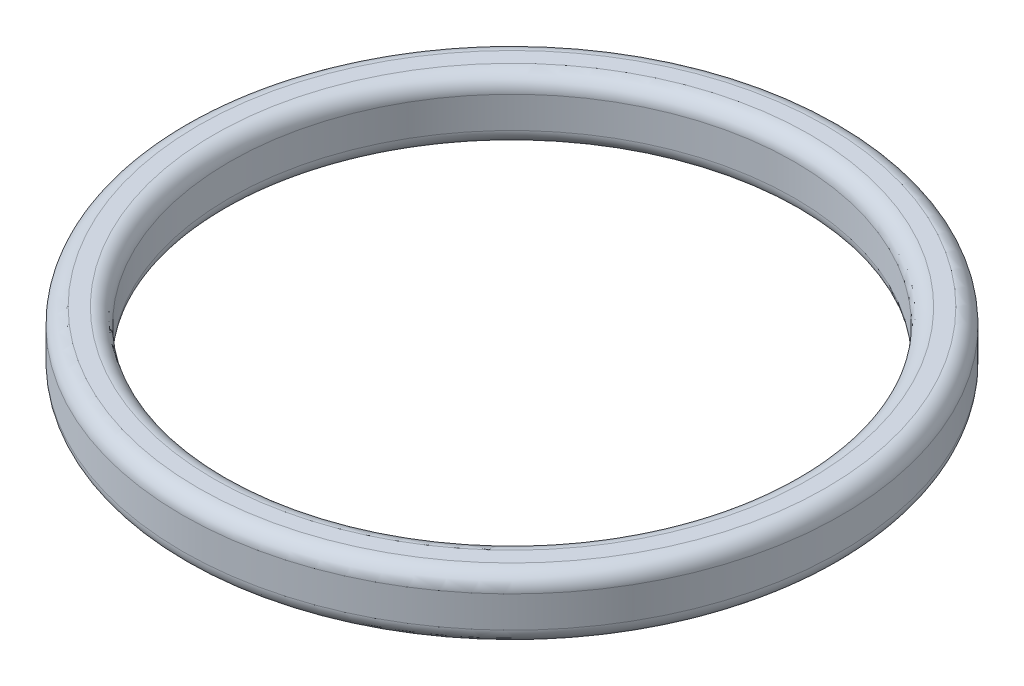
ISO-10303-21;
HEADER;
FILE_DESCRIPTION(('STEP AP214'),'2;1');
FILE_NAME('part.step','',(''),(''),'','','');
FILE_SCHEMA(('AUTOMOTIVE_DESIGN { 1 0 10303 214 1 1 1 1 }'));
ENDSEC;
DATA;
#1=APPLICATION_CONTEXT('core data for automotive mechanical design processes');
#2=APPLICATION_PROTOCOL_DEFINITION('international standard','automotive_design',2000,#1);
#3=PRODUCT_CONTEXT('',#1,'mechanical');
#4=PRODUCT('Part','Part','',(#3));
#5=PRODUCT_RELATED_PRODUCT_CATEGORY('part','',(#4));
#6=PRODUCT_DEFINITION_FORMATION('','',#4);
#7=PRODUCT_DEFINITION_CONTEXT('part definition',#1,'design');
#8=PRODUCT_DEFINITION('design','',#6,#7);
#9=PRODUCT_DEFINITION_SHAPE('','',#8);
#10=(LENGTH_UNIT() NAMED_UNIT(*) SI_UNIT(.MILLI.,.METRE.));
#11=(NAMED_UNIT(*) PLANE_ANGLE_UNIT() SI_UNIT($,.RADIAN.));
#12=(NAMED_UNIT(*) SI_UNIT($,.STERADIAN.) SOLID_ANGLE_UNIT());
#13=UNCERTAINTY_MEASURE_WITH_UNIT(LENGTH_MEASURE(1.E-05),#10,'distance_accuracy_value','');
#14=(GEOMETRIC_REPRESENTATION_CONTEXT(3) GLOBAL_UNCERTAINTY_ASSIGNED_CONTEXT((#13)) GLOBAL_UNIT_ASSIGNED_CONTEXT((#10,
#11,#12)) REPRESENTATION_CONTEXT('',''));
#15=CARTESIAN_POINT('',(0.,0.,0.));
#16=DIRECTION('',(0.,0.,1.));
#17=DIRECTION('',(1.,0.,0.));
#18=AXIS2_PLACEMENT_3D('',#15,#16,#17);
#19=CARTESIAN_POINT('',(0.,20.55,0.));
#20=DIRECTION('',(0.,-1.,0.));
#21=DIRECTION('',(0.,0.,-1.));
#22=AXIS2_PLACEMENT_3D('',#19,#20,#21);
#23=TOROIDAL_SURFACE('',#22,10.,0.500000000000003);
#24=CARTESIAN_POINT('',(0.,20.55,0.));
#25=DIRECTION('',(0.,-1.,0.));
#26=DIRECTION('',(0.,0.,-1.));
#27=AXIS2_PLACEMENT_3D('',#24,#25,#26);
#28=CIRCLE('',#27,10.5);
#29=CARTESIAN_POINT('',(0.,20.55,-10.5));
#30=VERTEX_POINT('',#29);
#31=EDGE_CURVE('E376',#30,#30,#28,.T.);
#32=ORIENTED_EDGE('',*,*,#31,.F.);
#33=EDGE_LOOP('',(#32));
#34=FACE_BOUND('',#33,.T.);
#35=CARTESIAN_POINT('',(0.,21.05,0.));
#36=DIRECTION('',(0.,-1.,0.));
#37=DIRECTION('',(0.,0.,-1.));
#38=AXIS2_PLACEMENT_3D('',#35,#36,#37);
#39=CIRCLE('',#38,10.);
#40=CARTESIAN_POINT('',(0.,21.05,-10.));
#41=VERTEX_POINT('',#40);
#42=EDGE_CURVE('E10',#41,#41,#39,.T.);
#43=ORIENTED_EDGE('',*,*,#42,.T.);
#44=EDGE_LOOP('',(#43));
#45=FACE_BOUND('',#44,.T.);
#46=ADVANCED_FACE('F348',(#34,#45),#23,.T.);
#47=CARTESIAN_POINT('',(-10.,21.05,0.));
#48=DIRECTION('',(0.,-1.,0.));
#49=DIRECTION('',(0.,0.,-1.));
#50=AXIS2_PLACEMENT_3D('',#47,#48,#49);
#51=PLANE('',#50);
#52=ORIENTED_EDGE('',*,*,#42,.F.);
#53=EDGE_LOOP('',(#52));
#54=FACE_BOUND('',#53,.T.);
#55=CARTESIAN_POINT('',(0.,21.05,0.));
#56=DIRECTION('',(0.,-1.,0.));
#57=DIRECTION('',(0.,0.,-1.));
#58=AXIS2_PLACEMENT_3D('',#55,#56,#57);
#59=CIRCLE('',#58,9.50000000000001);
#60=CARTESIAN_POINT('',(0.,21.05,-9.50000000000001));
#61=VERTEX_POINT('',#60);
#62=EDGE_CURVE('E354',#61,#61,#59,.T.);
#63=ORIENTED_EDGE('',*,*,#62,.T.);
#64=EDGE_LOOP('',(#63));
#65=FACE_BOUND('',#64,.T.);
#66=ADVANCED_FACE('F383',(#54,#65),#51,.F.);
#67=CARTESIAN_POINT('',(0.,20.55,0.));
#68=DIRECTION('',(0.,-1.,0.));
#69=DIRECTION('',(0.,0.,-1.));
#70=AXIS2_PLACEMENT_3D('',#67,#68,#69);
#71=TOROIDAL_SURFACE('',#70,9.50000000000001,0.500000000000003);
#72=ORIENTED_EDGE('',*,*,#62,.F.);
#73=EDGE_LOOP('',(#72));
#74=FACE_BOUND('',#73,.T.);
#75=CARTESIAN_POINT('',(0.,20.55,0.));
#76=DIRECTION('',(0.,-1.,0.));
#77=DIRECTION('',(0.,0.,-1.));
#78=AXIS2_PLACEMENT_3D('',#75,#76,#77);
#79=CIRCLE('',#78,9.);
#80=CARTESIAN_POINT('',(0.,20.55,-9.));
#81=VERTEX_POINT('',#80);
#82=EDGE_CURVE('E358',#81,#81,#79,.T.);
#83=ORIENTED_EDGE('',*,*,#82,.T.);
#84=EDGE_LOOP('',(#83));
#85=FACE_BOUND('',#84,.T.);
#86=ADVANCED_FACE('F387',(#74,#85),#71,.T.);
#87=CARTESIAN_POINT('',(0.,0.,0.));
#88=DIRECTION('',(0.,-1.,0.));
#89=DIRECTION('',(0.,0.,-1.));
#90=AXIS2_PLACEMENT_3D('',#87,#88,#89);
#91=CYLINDRICAL_SURFACE('',#90,9.);
#92=ORIENTED_EDGE('',*,*,#82,.F.);
#93=EDGE_LOOP('',(#92));
#94=FACE_BOUND('',#93,.T.);
#95=CARTESIAN_POINT('',(0.,19.55,0.));
#96=DIRECTION('',(0.,-1.,0.));
#97=DIRECTION('',(0.,0.,-1.));
#98=AXIS2_PLACEMENT_3D('',#95,#96,#97);
#99=CIRCLE('',#98,9.);
#100=CARTESIAN_POINT('',(0.,19.55,-9.));
#101=VERTEX_POINT('',#100);
#102=EDGE_CURVE('E362',#101,#101,#99,.T.);
#103=ORIENTED_EDGE('',*,*,#102,.T.);
#104=EDGE_LOOP('',(#103));
#105=FACE_BOUND('',#104,.T.);
#106=ADVANCED_FACE('F392',(#94,#105),#91,.F.);
#107=CARTESIAN_POINT('',(0.,19.55,0.));
#108=DIRECTION('',(0.,-1.,0.));
#109=DIRECTION('',(0.,0.,-1.));
#110=AXIS2_PLACEMENT_3D('',#107,#108,#109);
#111=TOROIDAL_SURFACE('',#110,9.50000000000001,0.500000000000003);
#112=ORIENTED_EDGE('',*,*,#102,.F.);
#113=EDGE_LOOP('',(#112));
#114=FACE_BOUND('',#113,.T.);
#115=CARTESIAN_POINT('',(0.,19.05,0.));
#116=DIRECTION('',(0.,-1.,0.));
#117=DIRECTION('',(0.,0.,-1.));
#118=AXIS2_PLACEMENT_3D('',#115,#116,#117);
#119=CIRCLE('',#118,9.50000000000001);
#120=CARTESIAN_POINT('',(0.,19.05,-9.50000000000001));
#121=VERTEX_POINT('',#120);
#122=EDGE_CURVE('E367',#121,#121,#119,.T.);
#123=ORIENTED_EDGE('',*,*,#122,.T.);
#124=EDGE_LOOP('',(#123));
#125=FACE_BOUND('',#124,.T.);
#126=ADVANCED_FACE('F398',(#114,#125),#111,.T.);
#127=CARTESIAN_POINT('',(-10.,19.05,0.));
#128=DIRECTION('',(0.,1.,0.));
#129=DIRECTION('',(0.,0.,1.));
#130=AXIS2_PLACEMENT_3D('',#127,#128,#129);
#131=PLANE('',#130);
#132=ORIENTED_EDGE('',*,*,#122,.F.);
#133=EDGE_LOOP('',(#132));
#134=FACE_BOUND('',#133,.T.);
#135=CARTESIAN_POINT('',(0.,19.05,0.));
#136=DIRECTION('',(0.,-1.,0.));
#137=DIRECTION('',(0.,0.,-1.));
#138=AXIS2_PLACEMENT_3D('',#135,#136,#137);
#139=CIRCLE('',#138,10.);
#140=CARTESIAN_POINT('',(0.,19.05,-10.));
#141=VERTEX_POINT('',#140);
#142=EDGE_CURVE('E370',#141,#141,#139,.T.);
#143=ORIENTED_EDGE('',*,*,#142,.T.);
#144=EDGE_LOOP('',(#143));
#145=FACE_BOUND('',#144,.T.);
#146=ADVANCED_FACE('F402',(#134,#145),#131,.F.);
#147=CARTESIAN_POINT('',(0.,19.55,0.));
#148=DIRECTION('',(0.,-1.,0.));
#149=DIRECTION('',(0.,0.,-1.));
#150=AXIS2_PLACEMENT_3D('',#147,#148,#149);
#151=TOROIDAL_SURFACE('',#150,10.,0.500000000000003);
#152=ORIENTED_EDGE('',*,*,#142,.F.);
#153=EDGE_LOOP('',(#152));
#154=FACE_BOUND('',#153,.T.);
#155=CARTESIAN_POINT('',(0.,19.55,0.));
#156=DIRECTION('',(0.,-1.,0.));
#157=DIRECTION('',(0.,0.,-1.));
#158=AXIS2_PLACEMENT_3D('',#155,#156,#157);
#159=CIRCLE('',#158,10.5);
#160=CARTESIAN_POINT('',(0.,19.55,-10.5));
#161=VERTEX_POINT('',#160);
#162=EDGE_CURVE('E373',#161,#161,#159,.T.);
#163=ORIENTED_EDGE('',*,*,#162,.T.);
#164=EDGE_LOOP('',(#163));
#165=FACE_BOUND('',#164,.T.);
#166=ADVANCED_FACE('F406',(#154,#165),#151,.T.);
#167=CARTESIAN_POINT('',(0.,0.,0.));
#168=DIRECTION('',(0.,-1.,0.));
#169=DIRECTION('',(0.,0.,-1.));
#170=AXIS2_PLACEMENT_3D('',#167,#168,#169);
#171=CYLINDRICAL_SURFACE('',#170,10.5);
#172=ORIENTED_EDGE('',*,*,#162,.F.);
#173=EDGE_LOOP('',(#172));
#174=FACE_BOUND('',#173,.T.);
#175=ORIENTED_EDGE('',*,*,#31,.T.);
#176=EDGE_LOOP('',(#175));
#177=FACE_BOUND('',#176,.T.);
#178=ADVANCED_FACE('F380',(#174,#177),#171,.T.);
#179=CLOSED_SHELL('',(#46,#66,#86,#106,#126,#146,#166,#178));
#180=MANIFOLD_SOLID_BREP('B2',#179);
#181=ADVANCED_BREP_SHAPE_REPRESENTATION('',(#18,#180),#14);
#182=SHAPE_DEFINITION_REPRESENTATION(#9,#181);
ENDSEC;
END-ISO-10303-21;
